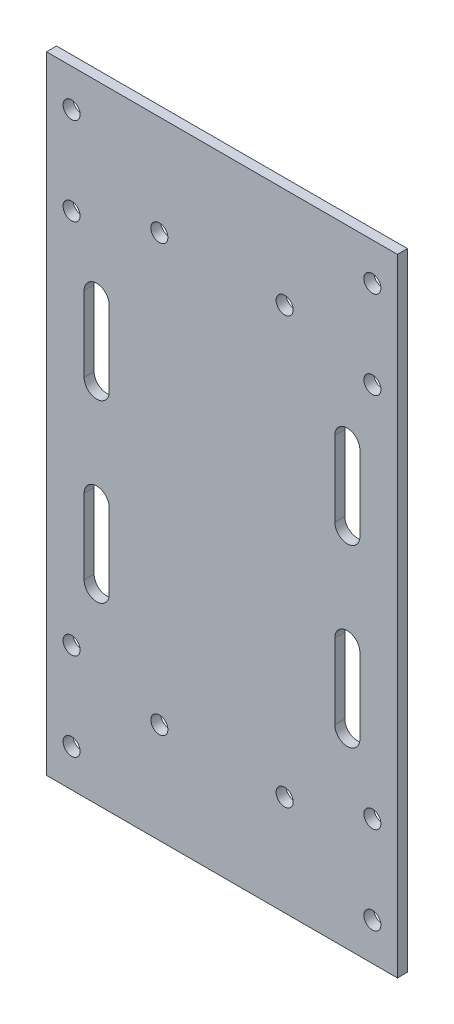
ISO-10303-21;
HEADER;
FILE_DESCRIPTION(('STEP AP214'),'2;1');
FILE_NAME('part.step','',(''),(''),'','','');
FILE_SCHEMA(('AUTOMOTIVE_DESIGN { 1 0 10303 214 1 1 1 1 }'));
ENDSEC;
DATA;
#1=APPLICATION_CONTEXT('core data for automotive mechanical design processes');
#2=APPLICATION_PROTOCOL_DEFINITION('international standard','automotive_design',2000,#1);
#3=PRODUCT_CONTEXT('',#1,'mechanical');
#4=PRODUCT('Part','Part','',(#3));
#5=PRODUCT_RELATED_PRODUCT_CATEGORY('part','',(#4));
#6=PRODUCT_DEFINITION_FORMATION('','',#4);
#7=PRODUCT_DEFINITION_CONTEXT('part definition',#1,'design');
#8=PRODUCT_DEFINITION('design','',#6,#7);
#9=PRODUCT_DEFINITION_SHAPE('','',#8);
#10=(LENGTH_UNIT() NAMED_UNIT(*) SI_UNIT(.MILLI.,.METRE.));
#11=(NAMED_UNIT(*) PLANE_ANGLE_UNIT() SI_UNIT($,.RADIAN.));
#12=(NAMED_UNIT(*) SI_UNIT($,.STERADIAN.) SOLID_ANGLE_UNIT());
#13=UNCERTAINTY_MEASURE_WITH_UNIT(LENGTH_MEASURE(1.E-05),#10,'distance_accuracy_value','');
#14=(GEOMETRIC_REPRESENTATION_CONTEXT(3) GLOBAL_UNCERTAINTY_ASSIGNED_CONTEXT((#13)) GLOBAL_UNIT_ASSIGNED_CONTEXT((#10,
#11,#12)) REPRESENTATION_CONTEXT('',''));
#15=CARTESIAN_POINT('',(0.,0.,0.));
#16=DIRECTION('',(0.,0.,1.));
#17=DIRECTION('',(1.,0.,0.));
#18=AXIS2_PLACEMENT_3D('',#15,#16,#17);
#19=CARTESIAN_POINT('',(0.,0.,0.));
#20=DIRECTION('',(0.,0.,-1.));
#21=DIRECTION('',(-1.,0.,0.));
#22=AXIS2_PLACEMENT_3D('',#19,#20,#21);
#23=PLANE('',#22);
#24=CARTESIAN_POINT('',(25.,-25.,0.));
#25=DIRECTION('',(0.,0.,-1.));
#26=DIRECTION('',(-1.,0.,0.));
#27=AXIS2_PLACEMENT_3D('',#24,#25,#26);
#28=CIRCLE('',#27,2.5);
#29=CARTESIAN_POINT('',(22.5,-25.,0.));
#30=VERTEX_POINT('',#29);
#31=CARTESIAN_POINT('',(27.5,-25.,0.));
#32=VERTEX_POINT('',#31);
#33=EDGE_CURVE('E556',#30,#32,#28,.F.);
#34=ORIENTED_EDGE('',*,*,#33,.F.);
#35=DIRECTION('',(0.,-1.,0.));
#36=VECTOR('',#35,1.);
#37=CARTESIAN_POINT('',(22.5,0.,0.));
#38=LINE('',#37,#36);
#39=CARTESIAN_POINT('',(22.5,-10.,0.));
#40=VERTEX_POINT('',#39);
#41=EDGE_CURVE('E261',#40,#30,#38,.T.);
#42=ORIENTED_EDGE('',*,*,#41,.F.);
#43=CARTESIAN_POINT('',(25.,-10.,0.));
#44=DIRECTION('',(0.,0.,-1.));
#45=DIRECTION('',(-1.,0.,0.));
#46=AXIS2_PLACEMENT_3D('',#43,#44,#45);
#47=CIRCLE('',#46,2.5);
#48=CARTESIAN_POINT('',(27.5,-10.,0.));
#49=VERTEX_POINT('',#48);
#50=EDGE_CURVE('E565',#49,#40,#47,.F.);
#51=ORIENTED_EDGE('',*,*,#50,.F.);
#52=DIRECTION('',(0.,1.,0.));
#53=VECTOR('',#52,1.);
#54=CARTESIAN_POINT('',(27.5,0.,0.));
#55=LINE('',#54,#53);
#56=EDGE_CURVE('E262',#32,#49,#55,.T.);
#57=ORIENTED_EDGE('',*,*,#56,.F.);
#58=EDGE_LOOP('',(#34,#42,#51,#57));
#59=FACE_BOUND('',#58,.T.);
#60=CARTESIAN_POINT('',(-25.,25.,0.));
#61=DIRECTION('',(0.,0.,-1.));
#62=DIRECTION('',(-1.,0.,0.));
#63=AXIS2_PLACEMENT_3D('',#60,#61,#62);
#64=CIRCLE('',#63,2.5);
#65=CARTESIAN_POINT('',(-22.5,25.,0.));
#66=VERTEX_POINT('',#65);
#67=CARTESIAN_POINT('',(-27.5,25.,0.));
#68=VERTEX_POINT('',#67);
#69=EDGE_CURVE('E567',#66,#68,#64,.F.);
#70=ORIENTED_EDGE('',*,*,#69,.F.);
#71=DIRECTION('',(0.,1.,0.));
#72=VECTOR('',#71,1.);
#73=CARTESIAN_POINT('',(-22.5,0.,0.));
#74=LINE('',#73,#72);
#75=CARTESIAN_POINT('',(-22.5,10.,0.));
#76=VERTEX_POINT('',#75);
#77=EDGE_CURVE('E269',#76,#66,#74,.T.);
#78=ORIENTED_EDGE('',*,*,#77,.F.);
#79=CARTESIAN_POINT('',(-25.,10.,0.));
#80=DIRECTION('',(0.,0.,-1.));
#81=DIRECTION('',(-1.,0.,0.));
#82=AXIS2_PLACEMENT_3D('',#79,#80,#81);
#83=CIRCLE('',#82,2.5);
#84=CARTESIAN_POINT('',(-27.5,10.,0.));
#85=VERTEX_POINT('',#84);
#86=EDGE_CURVE('E192',#85,#76,#83,.F.);
#87=ORIENTED_EDGE('',*,*,#86,.F.);
#88=DIRECTION('',(0.,-1.,0.));
#89=VECTOR('',#88,1.);
#90=CARTESIAN_POINT('',(-27.5,0.,0.));
#91=LINE('',#90,#89);
#92=EDGE_CURVE('E270',#68,#85,#91,.T.);
#93=ORIENTED_EDGE('',*,*,#92,.F.);
#94=EDGE_LOOP('',(#70,#78,#87,#93));
#95=FACE_BOUND('',#94,.T.);
#96=CARTESIAN_POINT('',(-25.,-10.,0.));
#97=DIRECTION('',(0.,0.,-1.));
#98=DIRECTION('',(-1.,0.,0.));
#99=AXIS2_PLACEMENT_3D('',#96,#97,#98);
#100=CIRCLE('',#99,2.5);
#101=CARTESIAN_POINT('',(-22.5,-10.,0.));
#102=VERTEX_POINT('',#101);
#103=CARTESIAN_POINT('',(-27.5,-10.,0.));
#104=VERTEX_POINT('',#103);
#105=EDGE_CURVE('E579',#102,#104,#100,.F.);
#106=ORIENTED_EDGE('',*,*,#105,.F.);
#107=DIRECTION('',(0.,1.,0.));
#108=VECTOR('',#107,1.);
#109=CARTESIAN_POINT('',(-22.5,0.,0.));
#110=LINE('',#109,#108);
#111=CARTESIAN_POINT('',(-22.5,-25.,0.));
#112=VERTEX_POINT('',#111);
#113=EDGE_CURVE('E252',#112,#102,#110,.T.);
#114=ORIENTED_EDGE('',*,*,#113,.F.);
#115=CARTESIAN_POINT('',(-25.,-25.,0.));
#116=DIRECTION('',(0.,0.,-1.));
#117=DIRECTION('',(-1.,0.,0.));
#118=AXIS2_PLACEMENT_3D('',#115,#116,#117);
#119=CIRCLE('',#118,2.5);
#120=CARTESIAN_POINT('',(-27.5,-25.,0.));
#121=VERTEX_POINT('',#120);
#122=EDGE_CURVE('E576',#121,#112,#119,.F.);
#123=ORIENTED_EDGE('',*,*,#122,.F.);
#124=DIRECTION('',(0.,-1.,0.));
#125=VECTOR('',#124,1.);
#126=CARTESIAN_POINT('',(-27.5,0.,0.));
#127=LINE('',#126,#125);
#128=EDGE_CURVE('E248',#104,#121,#127,.T.);
#129=ORIENTED_EDGE('',*,*,#128,.F.);
#130=EDGE_LOOP('',(#106,#114,#123,#129));
#131=FACE_BOUND('',#130,.T.);
#132=CARTESIAN_POINT('',(25.,10.,0.));
#133=DIRECTION('',(0.,0.,-1.));
#134=DIRECTION('',(-1.,0.,0.));
#135=AXIS2_PLACEMENT_3D('',#132,#133,#134);
#136=CIRCLE('',#135,2.5);
#137=CARTESIAN_POINT('',(22.5,10.,0.));
#138=VERTEX_POINT('',#137);
#139=CARTESIAN_POINT('',(27.5,10.,0.));
#140=VERTEX_POINT('',#139);
#141=EDGE_CURVE('E566',#138,#140,#136,.F.);
#142=ORIENTED_EDGE('',*,*,#141,.F.);
#143=DIRECTION('',(0.,-1.,0.));
#144=VECTOR('',#143,1.);
#145=CARTESIAN_POINT('',(22.5,0.,0.));
#146=LINE('',#145,#144);
#147=CARTESIAN_POINT('',(22.5,25.,0.));
#148=VERTEX_POINT('',#147);
#149=EDGE_CURVE('E254',#148,#138,#146,.T.);
#150=ORIENTED_EDGE('',*,*,#149,.F.);
#151=CARTESIAN_POINT('',(25.,25.,0.));
#152=DIRECTION('',(0.,0.,-1.));
#153=DIRECTION('',(-1.,0.,0.));
#154=AXIS2_PLACEMENT_3D('',#151,#152,#153);
#155=CIRCLE('',#154,2.5);
#156=CARTESIAN_POINT('',(27.5,25.,0.));
#157=VERTEX_POINT('',#156);
#158=EDGE_CURVE('E575',#157,#148,#155,.F.);
#159=ORIENTED_EDGE('',*,*,#158,.F.);
#160=DIRECTION('',(0.,1.,0.));
#161=VECTOR('',#160,1.);
#162=CARTESIAN_POINT('',(27.5,0.,0.));
#163=LINE('',#162,#161);
#164=EDGE_CURVE('E256',#140,#157,#163,.T.);
#165=ORIENTED_EDGE('',*,*,#164,.F.);
#166=EDGE_LOOP('',(#142,#150,#159,#165));
#167=FACE_BOUND('',#166,.T.);
#168=DIRECTION('',(0.,1.,0.));
#169=VECTOR('',#168,1.);
#170=CARTESIAN_POINT('',(35.,-62.5,0.));
#171=LINE('',#170,#169);
#172=CARTESIAN_POINT('',(35.,-62.5,0.));
#173=VERTEX_POINT('',#172);
#174=CARTESIAN_POINT('',(35.,62.5,0.));
#175=VERTEX_POINT('',#174);
#176=EDGE_CURVE('E964',#173,#175,#171,.T.);
#177=ORIENTED_EDGE('',*,*,#176,.T.);
#178=DIRECTION('',(-1.,0.,0.));
#179=VECTOR('',#178,1.);
#180=CARTESIAN_POINT('',(-35.,62.5,0.));
#181=LINE('',#180,#179);
#182=CARTESIAN_POINT('',(-35.,62.5,0.));
#183=VERTEX_POINT('',#182);
#184=EDGE_CURVE('E968',#175,#183,#181,.T.);
#185=ORIENTED_EDGE('',*,*,#184,.T.);
#186=DIRECTION('',(0.,-1.,0.));
#187=VECTOR('',#186,1.);
#188=CARTESIAN_POINT('',(-35.,-62.5,0.));
#189=LINE('',#188,#187);
#190=CARTESIAN_POINT('',(-35.,-62.5,0.));
#191=VERTEX_POINT('',#190);
#192=EDGE_CURVE('E969',#183,#191,#189,.T.);
#193=ORIENTED_EDGE('',*,*,#192,.T.);
#194=DIRECTION('',(1.,0.,0.));
#195=VECTOR('',#194,1.);
#196=CARTESIAN_POINT('',(-35.,-62.5,0.));
#197=LINE('',#196,#195);
#198=EDGE_CURVE('E966',#191,#173,#197,.T.);
#199=ORIENTED_EDGE('',*,*,#198,.T.);
#200=EDGE_LOOP('',(#177,#185,#193,#199));
#201=FACE_BOUND('',#200,.T.);
#202=CARTESIAN_POINT('',(-30.,-55.,1.2E-05));
#203=DIRECTION('',(0.,0.,1.));
#204=DIRECTION('',(1.,0.,0.));
#205=AXIS2_PLACEMENT_3D('',#202,#203,#204);
#206=CIRCLE('',#205,1.7);
#207=CARTESIAN_POINT('',(-28.3,-55.,1.2E-05));
#208=VERTEX_POINT('',#207);
#209=EDGE_CURVE('E317',#208,#208,#206,.T.);
#210=ORIENTED_EDGE('',*,*,#209,.F.);
#211=EDGE_LOOP('',(#210));
#212=FACE_BOUND('',#211,.T.);
#213=CARTESIAN_POINT('',(-12.5,42.5,1.2E-05));
#214=DIRECTION('',(0.,0.,1.));
#215=DIRECTION('',(1.,0.,0.));
#216=AXIS2_PLACEMENT_3D('',#213,#214,#215);
#217=CIRCLE('',#216,1.7);
#218=CARTESIAN_POINT('',(-10.8,42.5,1.2E-05));
#219=VERTEX_POINT('',#218);
#220=EDGE_CURVE('E283',#219,#219,#217,.T.);
#221=ORIENTED_EDGE('',*,*,#220,.F.);
#222=EDGE_LOOP('',(#221));
#223=FACE_BOUND('',#222,.T.);
#224=CARTESIAN_POINT('',(12.5,-42.5,1.2E-05));
#225=DIRECTION('',(0.,0.,1.));
#226=DIRECTION('',(1.,0.,0.));
#227=AXIS2_PLACEMENT_3D('',#224,#225,#226);
#228=CIRCLE('',#227,1.7);
#229=CARTESIAN_POINT('',(14.2,-42.5,1.2E-05));
#230=VERTEX_POINT('',#229);
#231=EDGE_CURVE('E277',#230,#230,#228,.T.);
#232=ORIENTED_EDGE('',*,*,#231,.F.);
#233=EDGE_LOOP('',(#232));
#234=FACE_BOUND('',#233,.T.);
#235=CARTESIAN_POINT('',(12.5,42.5,1.2E-05));
#236=DIRECTION('',(0.,0.,1.));
#237=DIRECTION('',(1.,0.,0.));
#238=AXIS2_PLACEMENT_3D('',#235,#236,#237);
#239=CIRCLE('',#238,1.7);
#240=CARTESIAN_POINT('',(14.2,42.5,1.2E-05));
#241=VERTEX_POINT('',#240);
#242=EDGE_CURVE('E275',#241,#241,#239,.T.);
#243=ORIENTED_EDGE('',*,*,#242,.F.);
#244=EDGE_LOOP('',(#243));
#245=FACE_BOUND('',#244,.T.);
#246=CARTESIAN_POINT('',(30.,-55.,1.2E-05));
#247=DIRECTION('',(0.,0.,1.));
#248=DIRECTION('',(1.,0.,0.));
#249=AXIS2_PLACEMENT_3D('',#246,#247,#248);
#250=CIRCLE('',#249,1.7);
#251=CARTESIAN_POINT('',(31.7,-55.,1.2E-05));
#252=VERTEX_POINT('',#251);
#253=EDGE_CURVE('E298',#252,#252,#250,.T.);
#254=ORIENTED_EDGE('',*,*,#253,.F.);
#255=EDGE_LOOP('',(#254));
#256=FACE_BOUND('',#255,.T.);
#257=CARTESIAN_POINT('',(-30.,55.,1.2E-05));
#258=DIRECTION('',(0.,0.,1.));
#259=DIRECTION('',(1.,0.,0.));
#260=AXIS2_PLACEMENT_3D('',#257,#258,#259);
#261=CIRCLE('',#260,1.7);
#262=CARTESIAN_POINT('',(-28.3,55.,1.2E-05));
#263=VERTEX_POINT('',#262);
#264=EDGE_CURVE('E305',#263,#263,#261,.T.);
#265=ORIENTED_EDGE('',*,*,#264,.F.);
#266=EDGE_LOOP('',(#265));
#267=FACE_BOUND('',#266,.T.);
#268=CARTESIAN_POINT('',(-30.,37.5,1.2E-05));
#269=DIRECTION('',(0.,0.,1.));
#270=DIRECTION('',(1.,0.,0.));
#271=AXIS2_PLACEMENT_3D('',#268,#269,#270);
#272=CIRCLE('',#271,1.7);
#273=CARTESIAN_POINT('',(-28.3,37.5,1.2E-05));
#274=VERTEX_POINT('',#273);
#275=EDGE_CURVE('E303',#274,#274,#272,.T.);
#276=ORIENTED_EDGE('',*,*,#275,.F.);
#277=EDGE_LOOP('',(#276));
#278=FACE_BOUND('',#277,.T.);
#279=CARTESIAN_POINT('',(-30.,-37.5,1.2E-05));
#280=DIRECTION('',(0.,0.,1.));
#281=DIRECTION('',(1.,0.,0.));
#282=AXIS2_PLACEMENT_3D('',#279,#280,#281);
#283=CIRCLE('',#282,1.7);
#284=CARTESIAN_POINT('',(-28.3,-37.5,1.2E-05));
#285=VERTEX_POINT('',#284);
#286=EDGE_CURVE('E311',#285,#285,#283,.T.);
#287=ORIENTED_EDGE('',*,*,#286,.F.);
#288=EDGE_LOOP('',(#287));
#289=FACE_BOUND('',#288,.T.);
#290=CARTESIAN_POINT('',(-12.5,-42.5,1.2E-05));
#291=DIRECTION('',(0.,0.,1.));
#292=DIRECTION('',(1.,0.,0.));
#293=AXIS2_PLACEMENT_3D('',#290,#291,#292);
#294=CIRCLE('',#293,1.7);
#295=CARTESIAN_POINT('',(-10.8,-42.5,1.2E-05));
#296=VERTEX_POINT('',#295);
#297=EDGE_CURVE('E278',#296,#296,#294,.T.);
#298=ORIENTED_EDGE('',*,*,#297,.F.);
#299=EDGE_LOOP('',(#298));
#300=FACE_BOUND('',#299,.T.);
#301=CARTESIAN_POINT('',(30.,55.,1.2E-05));
#302=DIRECTION('',(0.,0.,1.));
#303=DIRECTION('',(1.,0.,0.));
#304=AXIS2_PLACEMENT_3D('',#301,#302,#303);
#305=CIRCLE('',#304,1.7);
#306=CARTESIAN_POINT('',(31.7,55.,1.2E-05));
#307=VERTEX_POINT('',#306);
#308=EDGE_CURVE('E288',#307,#307,#305,.T.);
#309=ORIENTED_EDGE('',*,*,#308,.F.);
#310=EDGE_LOOP('',(#309));
#311=FACE_BOUND('',#310,.T.);
#312=CARTESIAN_POINT('',(30.,37.5,1.2E-05));
#313=DIRECTION('',(0.,0.,1.));
#314=DIRECTION('',(1.,0.,0.));
#315=AXIS2_PLACEMENT_3D('',#312,#313,#314);
#316=CIRCLE('',#315,1.7);
#317=CARTESIAN_POINT('',(31.7,37.5,1.2E-05));
#318=VERTEX_POINT('',#317);
#319=EDGE_CURVE('E289',#318,#318,#316,.T.);
#320=ORIENTED_EDGE('',*,*,#319,.F.);
#321=EDGE_LOOP('',(#320));
#322=FACE_BOUND('',#321,.T.);
#323=CARTESIAN_POINT('',(30.,-37.5,1.2E-05));
#324=DIRECTION('',(0.,0.,1.));
#325=DIRECTION('',(1.,0.,0.));
#326=AXIS2_PLACEMENT_3D('',#323,#324,#325);
#327=CIRCLE('',#326,1.7);
#328=CARTESIAN_POINT('',(31.7,-37.5,1.2E-05));
#329=VERTEX_POINT('',#328);
#330=EDGE_CURVE('E299',#329,#329,#327,.T.);
#331=ORIENTED_EDGE('',*,*,#330,.F.);
#332=EDGE_LOOP('',(#331));
#333=FACE_BOUND('',#332,.T.);
#334=ADVANCED_FACE('F39',(#59,#95,#131,#167,#201,#212,#223,#234,#245,#256,#267,#278,#289,#300,
#311,#322,#333),#23,.F.);
#335=CARTESIAN_POINT('',(0.,0.,-2.));
#336=DIRECTION('',(0.,0.,-1.));
#337=DIRECTION('',(-1.,0.,0.));
#338=AXIS2_PLACEMENT_3D('',#335,#336,#337);
#339=PLANE('',#338);
#340=CARTESIAN_POINT('',(30.,-37.5,-2.));
#341=DIRECTION('',(0.,0.,1.));
#342=DIRECTION('',(1.,0.,0.));
#343=AXIS2_PLACEMENT_3D('',#340,#341,#342);
#344=CIRCLE('',#343,1.7);
#345=CARTESIAN_POINT('',(31.7,-37.5,-2.));
#346=VERTEX_POINT('',#345);
#347=EDGE_CURVE('E291',#346,#346,#344,.T.);
#348=ORIENTED_EDGE('',*,*,#347,.T.);
#349=EDGE_LOOP('',(#348));
#350=FACE_BOUND('',#349,.T.);
#351=CARTESIAN_POINT('',(30.,37.5,-2.));
#352=DIRECTION('',(0.,0.,1.));
#353=DIRECTION('',(1.,0.,0.));
#354=AXIS2_PLACEMENT_3D('',#351,#352,#353);
#355=CIRCLE('',#354,1.7);
#356=CARTESIAN_POINT('',(31.7,37.5,-2.));
#357=VERTEX_POINT('',#356);
#358=EDGE_CURVE('E297',#357,#357,#355,.T.);
#359=ORIENTED_EDGE('',*,*,#358,.T.);
#360=EDGE_LOOP('',(#359));
#361=FACE_BOUND('',#360,.T.);
#362=CARTESIAN_POINT('',(30.,55.,-2.));
#363=DIRECTION('',(0.,0.,1.));
#364=DIRECTION('',(1.,0.,0.));
#365=AXIS2_PLACEMENT_3D('',#362,#363,#364);
#366=CIRCLE('',#365,1.7);
#367=CARTESIAN_POINT('',(31.7,55.,-2.));
#368=VERTEX_POINT('',#367);
#369=EDGE_CURVE('E281',#368,#368,#366,.T.);
#370=ORIENTED_EDGE('',*,*,#369,.T.);
#371=EDGE_LOOP('',(#370));
#372=FACE_BOUND('',#371,.T.);
#373=CARTESIAN_POINT('',(-12.5,-42.5,-2.));
#374=DIRECTION('',(0.,0.,1.));
#375=DIRECTION('',(1.,0.,0.));
#376=AXIS2_PLACEMENT_3D('',#373,#374,#375);
#377=CIRCLE('',#376,1.7);
#378=CARTESIAN_POINT('',(-10.8,-42.5,-2.));
#379=VERTEX_POINT('',#378);
#380=EDGE_CURVE('E290',#379,#379,#377,.T.);
#381=ORIENTED_EDGE('',*,*,#380,.T.);
#382=EDGE_LOOP('',(#381));
#383=FACE_BOUND('',#382,.T.);
#384=CARTESIAN_POINT('',(-30.,-37.5,-2.));
#385=DIRECTION('',(0.,0.,1.));
#386=DIRECTION('',(1.,0.,0.));
#387=AXIS2_PLACEMENT_3D('',#384,#385,#386);
#388=CIRCLE('',#387,1.7);
#389=CARTESIAN_POINT('',(-28.3,-37.5,-2.));
#390=VERTEX_POINT('',#389);
#391=EDGE_CURVE('E310',#390,#390,#388,.T.);
#392=ORIENTED_EDGE('',*,*,#391,.T.);
#393=EDGE_LOOP('',(#392));
#394=FACE_BOUND('',#393,.T.);
#395=CARTESIAN_POINT('',(-30.,37.5,-2.));
#396=DIRECTION('',(0.,0.,1.));
#397=DIRECTION('',(1.,0.,0.));
#398=AXIS2_PLACEMENT_3D('',#395,#396,#397);
#399=CIRCLE('',#398,1.7);
#400=CARTESIAN_POINT('',(-28.3,37.5,-2.));
#401=VERTEX_POINT('',#400);
#402=EDGE_CURVE('E314',#401,#401,#399,.T.);
#403=ORIENTED_EDGE('',*,*,#402,.T.);
#404=EDGE_LOOP('',(#403));
#405=FACE_BOUND('',#404,.T.);
#406=CARTESIAN_POINT('',(-30.,55.,-2.));
#407=DIRECTION('',(0.,0.,1.));
#408=DIRECTION('',(1.,0.,0.));
#409=AXIS2_PLACEMENT_3D('',#406,#407,#408);
#410=CIRCLE('',#409,1.7);
#411=CARTESIAN_POINT('',(-28.3,55.,-2.));
#412=VERTEX_POINT('',#411);
#413=EDGE_CURVE('E301',#412,#412,#410,.T.);
#414=ORIENTED_EDGE('',*,*,#413,.T.);
#415=EDGE_LOOP('',(#414));
#416=FACE_BOUND('',#415,.T.);
#417=CARTESIAN_POINT('',(30.,-55.,-2.));
#418=DIRECTION('',(0.,0.,1.));
#419=DIRECTION('',(1.,0.,0.));
#420=AXIS2_PLACEMENT_3D('',#417,#418,#419);
#421=CIRCLE('',#420,1.7);
#422=CARTESIAN_POINT('',(31.7,-55.,-2.));
#423=VERTEX_POINT('',#422);
#424=EDGE_CURVE('E308',#423,#423,#421,.T.);
#425=ORIENTED_EDGE('',*,*,#424,.T.);
#426=EDGE_LOOP('',(#425));
#427=FACE_BOUND('',#426,.T.);
#428=CARTESIAN_POINT('',(12.5,42.5,-2.));
#429=DIRECTION('',(0.,0.,1.));
#430=DIRECTION('',(1.,0.,0.));
#431=AXIS2_PLACEMENT_3D('',#428,#429,#430);
#432=CIRCLE('',#431,1.7);
#433=CARTESIAN_POINT('',(14.2,42.5,-2.));
#434=VERTEX_POINT('',#433);
#435=EDGE_CURVE('E272',#434,#434,#432,.T.);
#436=ORIENTED_EDGE('',*,*,#435,.T.);
#437=EDGE_LOOP('',(#436));
#438=FACE_BOUND('',#437,.T.);
#439=CARTESIAN_POINT('',(12.5,-42.5,-2.));
#440=DIRECTION('',(0.,0.,1.));
#441=DIRECTION('',(1.,0.,0.));
#442=AXIS2_PLACEMENT_3D('',#439,#440,#441);
#443=CIRCLE('',#442,1.7);
#444=CARTESIAN_POINT('',(14.2,-42.5,-2.));
#445=VERTEX_POINT('',#444);
#446=EDGE_CURVE('E284',#445,#445,#443,.T.);
#447=ORIENTED_EDGE('',*,*,#446,.T.);
#448=EDGE_LOOP('',(#447));
#449=FACE_BOUND('',#448,.T.);
#450=CARTESIAN_POINT('',(-12.5,42.5,-2.));
#451=DIRECTION('',(0.,0.,1.));
#452=DIRECTION('',(1.,0.,0.));
#453=AXIS2_PLACEMENT_3D('',#450,#451,#452);
#454=CIRCLE('',#453,1.7);
#455=CARTESIAN_POINT('',(-10.8,42.5,-2.));
#456=VERTEX_POINT('',#455);
#457=EDGE_CURVE('E280',#456,#456,#454,.T.);
#458=ORIENTED_EDGE('',*,*,#457,.T.);
#459=EDGE_LOOP('',(#458));
#460=FACE_BOUND('',#459,.T.);
#461=CARTESIAN_POINT('',(-30.,-55.,-2.));
#462=DIRECTION('',(0.,0.,1.));
#463=DIRECTION('',(1.,0.,0.));
#464=AXIS2_PLACEMENT_3D('',#461,#462,#463);
#465=CIRCLE('',#464,1.7);
#466=CARTESIAN_POINT('',(-28.3,-55.,-2.));
#467=VERTEX_POINT('',#466);
#468=EDGE_CURVE('E315',#467,#467,#465,.T.);
#469=ORIENTED_EDGE('',*,*,#468,.T.);
#470=EDGE_LOOP('',(#469));
#471=FACE_BOUND('',#470,.T.);
#472=DIRECTION('',(0.,1.,0.));
#473=VECTOR('',#472,1.);
#474=CARTESIAN_POINT('',(35.,-62.5,-2.));
#475=LINE('',#474,#473);
#476=CARTESIAN_POINT('',(35.,-62.5,-2.));
#477=VERTEX_POINT('',#476);
#478=CARTESIAN_POINT('',(35.,62.5,-2.));
#479=VERTEX_POINT('',#478);
#480=EDGE_CURVE('E420',#477,#479,#475,.T.);
#481=ORIENTED_EDGE('',*,*,#480,.F.);
#482=DIRECTION('',(1.,0.,0.));
#483=VECTOR('',#482,1.);
#484=CARTESIAN_POINT('',(-35.,-62.5,-2.));
#485=LINE('',#484,#483);
#486=CARTESIAN_POINT('',(-35.,-62.5,-2.));
#487=VERTEX_POINT('',#486);
#488=EDGE_CURVE('E977',#487,#477,#485,.T.);
#489=ORIENTED_EDGE('',*,*,#488,.F.);
#490=DIRECTION('',(0.,-1.,0.));
#491=VECTOR('',#490,1.);
#492=CARTESIAN_POINT('',(-35.,-62.5,-2.));
#493=LINE('',#492,#491);
#494=CARTESIAN_POINT('',(-35.,62.5,-2.));
#495=VERTEX_POINT('',#494);
#496=EDGE_CURVE('E987',#495,#487,#493,.T.);
#497=ORIENTED_EDGE('',*,*,#496,.F.);
#498=DIRECTION('',(-1.,0.,0.));
#499=VECTOR('',#498,1.);
#500=CARTESIAN_POINT('',(-35.,62.5,-2.));
#501=LINE('',#500,#499);
#502=EDGE_CURVE('E975',#479,#495,#501,.T.);
#503=ORIENTED_EDGE('',*,*,#502,.F.);
#504=EDGE_LOOP('',(#481,#489,#497,#503));
#505=FACE_BOUND('',#504,.T.);
#506=DIRECTION('',(0.,1.,0.));
#507=VECTOR('',#506,1.);
#508=CARTESIAN_POINT('',(-22.5,-25.,-2.));
#509=LINE('',#508,#507);
#510=CARTESIAN_POINT('',(-22.5,-25.,-2.));
#511=VERTEX_POINT('',#510);
#512=CARTESIAN_POINT('',(-22.5,-10.,-2.));
#513=VERTEX_POINT('',#512);
#514=EDGE_CURVE('E213',#511,#513,#509,.T.);
#515=ORIENTED_EDGE('',*,*,#514,.T.);
#516=CARTESIAN_POINT('',(-25.,-10.,-2.));
#517=DIRECTION('',(0.,0.,1.));
#518=DIRECTION('',(1.,0.,0.));
#519=AXIS2_PLACEMENT_3D('',#516,#517,#518);
#520=CIRCLE('',#519,2.5);
#521=CARTESIAN_POINT('',(-27.5,-10.,-2.));
#522=VERTEX_POINT('',#521);
#523=EDGE_CURVE('E210',#513,#522,#520,.T.);
#524=ORIENTED_EDGE('',*,*,#523,.T.);
#525=DIRECTION('',(0.,-1.,0.));
#526=VECTOR('',#525,1.);
#527=CARTESIAN_POINT('',(-27.5,-25.,-2.));
#528=LINE('',#527,#526);
#529=CARTESIAN_POINT('',(-27.5,-25.,-2.));
#530=VERTEX_POINT('',#529);
#531=EDGE_CURVE('E216',#522,#530,#528,.T.);
#532=ORIENTED_EDGE('',*,*,#531,.T.);
#533=CARTESIAN_POINT('',(-25.,-25.,-2.));
#534=DIRECTION('',(0.,0.,1.));
#535=DIRECTION('',(1.,0.,0.));
#536=AXIS2_PLACEMENT_3D('',#533,#534,#535);
#537=CIRCLE('',#536,2.5);
#538=EDGE_CURVE('E605',#530,#511,#537,.T.);
#539=ORIENTED_EDGE('',*,*,#538,.T.);
#540=EDGE_LOOP('',(#515,#524,#532,#539));
#541=FACE_BOUND('',#540,.T.);
#542=DIRECTION('',(0.,-1.,0.));
#543=VECTOR('',#542,1.);
#544=CARTESIAN_POINT('',(22.5,10.,-2.));
#545=LINE('',#544,#543);
#546=CARTESIAN_POINT('',(22.5,25.,-2.));
#547=VERTEX_POINT('',#546);
#548=CARTESIAN_POINT('',(22.5,10.,-2.));
#549=VERTEX_POINT('',#548);
#550=EDGE_CURVE('E546',#547,#549,#545,.T.);
#551=ORIENTED_EDGE('',*,*,#550,.T.);
#552=CARTESIAN_POINT('',(25.,10.,-2.));
#553=DIRECTION('',(0.,0.,1.));
#554=DIRECTION('',(1.,0.,0.));
#555=AXIS2_PLACEMENT_3D('',#552,#553,#554);
#556=CIRCLE('',#555,2.5);
#557=CARTESIAN_POINT('',(27.5,10.,-2.));
#558=VERTEX_POINT('',#557);
#559=EDGE_CURVE('E608',#549,#558,#556,.T.);
#560=ORIENTED_EDGE('',*,*,#559,.T.);
#561=DIRECTION('',(0.,1.,0.));
#562=VECTOR('',#561,1.);
#563=CARTESIAN_POINT('',(27.5,10.,-2.));
#564=LINE('',#563,#562);
#565=CARTESIAN_POINT('',(27.5,25.,-2.));
#566=VERTEX_POINT('',#565);
#567=EDGE_CURVE('E221',#558,#566,#564,.T.);
#568=ORIENTED_EDGE('',*,*,#567,.T.);
#569=CARTESIAN_POINT('',(25.,25.,-2.));
#570=DIRECTION('',(0.,0.,1.));
#571=DIRECTION('',(1.,0.,0.));
#572=AXIS2_PLACEMENT_3D('',#569,#570,#571);
#573=CIRCLE('',#572,2.5);
#574=EDGE_CURVE('E609',#566,#547,#573,.T.);
#575=ORIENTED_EDGE('',*,*,#574,.T.);
#576=EDGE_LOOP('',(#551,#560,#568,#575));
#577=FACE_BOUND('',#576,.T.);
#578=DIRECTION('',(0.,-1.,0.));
#579=VECTOR('',#578,1.);
#580=CARTESIAN_POINT('',(22.5,-25.,-2.));
#581=LINE('',#580,#579);
#582=CARTESIAN_POINT('',(22.5,-10.,-2.));
#583=VERTEX_POINT('',#582);
#584=CARTESIAN_POINT('',(22.5,-25.,-2.));
#585=VERTEX_POINT('',#584);
#586=EDGE_CURVE('E231',#583,#585,#581,.T.);
#587=ORIENTED_EDGE('',*,*,#586,.T.);
#588=CARTESIAN_POINT('',(25.,-25.,-2.));
#589=DIRECTION('',(0.,0.,1.));
#590=DIRECTION('',(1.,0.,0.));
#591=AXIS2_PLACEMENT_3D('',#588,#589,#590);
#592=CIRCLE('',#591,2.5);
#593=CARTESIAN_POINT('',(27.5,-25.,-2.));
#594=VERTEX_POINT('',#593);
#595=EDGE_CURVE('E549',#585,#594,#592,.T.);
#596=ORIENTED_EDGE('',*,*,#595,.T.);
#597=DIRECTION('',(0.,1.,0.));
#598=VECTOR('',#597,1.);
#599=CARTESIAN_POINT('',(27.5,-25.,-2.));
#600=LINE('',#599,#598);
#601=CARTESIAN_POINT('',(27.5,-10.,-2.));
#602=VERTEX_POINT('',#601);
#603=EDGE_CURVE('E233',#594,#602,#600,.T.);
#604=ORIENTED_EDGE('',*,*,#603,.T.);
#605=CARTESIAN_POINT('',(25.,-10.,-2.));
#606=DIRECTION('',(0.,0.,1.));
#607=DIRECTION('',(1.,0.,0.));
#608=AXIS2_PLACEMENT_3D('',#605,#606,#607);
#609=CIRCLE('',#608,2.5);
#610=EDGE_CURVE('E555',#602,#583,#609,.T.);
#611=ORIENTED_EDGE('',*,*,#610,.T.);
#612=EDGE_LOOP('',(#587,#596,#604,#611));
#613=FACE_BOUND('',#612,.T.);
#614=DIRECTION('',(0.,1.,0.));
#615=VECTOR('',#614,1.);
#616=CARTESIAN_POINT('',(-22.5,10.,-2.));
#617=LINE('',#616,#615);
#618=CARTESIAN_POINT('',(-22.5,10.,-2.));
#619=VERTEX_POINT('',#618);
#620=CARTESIAN_POINT('',(-22.5,25.,-2.));
#621=VERTEX_POINT('',#620);
#622=EDGE_CURVE('E202',#619,#621,#617,.T.);
#623=ORIENTED_EDGE('',*,*,#622,.T.);
#624=CARTESIAN_POINT('',(-25.,25.,-2.));
#625=DIRECTION('',(0.,0.,1.));
#626=DIRECTION('',(1.,0.,0.));
#627=AXIS2_PLACEMENT_3D('',#624,#625,#626);
#628=CIRCLE('',#627,2.5);
#629=CARTESIAN_POINT('',(-27.5,25.,-2.));
#630=VERTEX_POINT('',#629);
#631=EDGE_CURVE('E208',#621,#630,#628,.T.);
#632=ORIENTED_EDGE('',*,*,#631,.T.);
#633=DIRECTION('',(0.,-1.,0.));
#634=VECTOR('',#633,1.);
#635=CARTESIAN_POINT('',(-27.5,10.,-2.));
#636=LINE('',#635,#634);
#637=CARTESIAN_POINT('',(-27.5,10.,-2.));
#638=VERTEX_POINT('',#637);
#639=EDGE_CURVE('E197',#630,#638,#636,.T.);
#640=ORIENTED_EDGE('',*,*,#639,.T.);
#641=CARTESIAN_POINT('',(-25.,10.,-2.));
#642=DIRECTION('',(0.,0.,1.));
#643=DIRECTION('',(1.,0.,0.));
#644=AXIS2_PLACEMENT_3D('',#641,#642,#643);
#645=CIRCLE('',#644,2.5);
#646=EDGE_CURVE('E190',#638,#619,#645,.T.);
#647=ORIENTED_EDGE('',*,*,#646,.T.);
#648=EDGE_LOOP('',(#623,#632,#640,#647));
#649=FACE_BOUND('',#648,.T.);
#650=ADVANCED_FACE('F201',(#350,#361,#372,#383,#394,#405,#416,#427,#438,#449,#460,#471,#505,
#541,#577,#613,#649),#339,.T.);
#651=CARTESIAN_POINT('',(35.,-62.5,-2.));
#652=DIRECTION('',(1.,0.,0.));
#653=DIRECTION('',(0.,0.,-1.));
#654=AXIS2_PLACEMENT_3D('',#651,#652,#653);
#655=PLANE('',#654);
#656=ORIENTED_EDGE('',*,*,#176,.F.);
#657=DIRECTION('',(0.,0.,1.));
#658=VECTOR('',#657,1.);
#659=CARTESIAN_POINT('',(35.,-62.5,-2.));
#660=LINE('',#659,#658);
#661=EDGE_CURVE('E11',#477,#173,#660,.T.);
#662=ORIENTED_EDGE('',*,*,#661,.F.);
#663=ORIENTED_EDGE('',*,*,#480,.T.);
#664=DIRECTION('',(0.,0.,1.));
#665=VECTOR('',#664,1.);
#666=CARTESIAN_POINT('',(35.,62.5,-2.));
#667=LINE('',#666,#665);
#668=EDGE_CURVE('E88',#479,#175,#667,.T.);
#669=ORIENTED_EDGE('',*,*,#668,.T.);
#670=EDGE_LOOP('',(#656,#662,#663,#669));
#671=FACE_BOUND('',#670,.T.);
#672=ADVANCED_FACE('F41',(#671),#655,.T.);
#673=CARTESIAN_POINT('',(-35.,-62.5,-2.));
#674=DIRECTION('',(0.,-1.,0.));
#675=DIRECTION('',(0.,0.,-1.));
#676=AXIS2_PLACEMENT_3D('',#673,#674,#675);
#677=PLANE('',#676);
#678=ORIENTED_EDGE('',*,*,#198,.F.);
#679=DIRECTION('',(0.,0.,1.));
#680=VECTOR('',#679,1.);
#681=CARTESIAN_POINT('',(-35.,-62.5,-2.));
#682=LINE('',#681,#680);
#683=EDGE_CURVE('E51',#487,#191,#682,.T.);
#684=ORIENTED_EDGE('',*,*,#683,.F.);
#685=ORIENTED_EDGE('',*,*,#488,.T.);
#686=ORIENTED_EDGE('',*,*,#661,.T.);
#687=EDGE_LOOP('',(#678,#684,#685,#686));
#688=FACE_BOUND('',#687,.T.);
#689=ADVANCED_FACE('F442',(#688),#677,.T.);
#690=CARTESIAN_POINT('',(-35.,-62.5,-2.));
#691=DIRECTION('',(-1.,0.,0.));
#692=DIRECTION('',(0.,0.,1.));
#693=AXIS2_PLACEMENT_3D('',#690,#691,#692);
#694=PLANE('',#693);
#695=ORIENTED_EDGE('',*,*,#192,.F.);
#696=DIRECTION('',(0.,0.,1.));
#697=VECTOR('',#696,1.);
#698=CARTESIAN_POINT('',(-35.,62.5,-2.));
#699=LINE('',#698,#697);
#700=EDGE_CURVE('E980',#495,#183,#699,.T.);
#701=ORIENTED_EDGE('',*,*,#700,.F.);
#702=ORIENTED_EDGE('',*,*,#496,.T.);
#703=ORIENTED_EDGE('',*,*,#683,.T.);
#704=EDGE_LOOP('',(#695,#701,#702,#703));
#705=FACE_BOUND('',#704,.T.);
#706=ADVANCED_FACE('F931',(#705),#694,.T.);
#707=CARTESIAN_POINT('',(-35.,62.5,-2.));
#708=DIRECTION('',(0.,1.,0.));
#709=DIRECTION('',(0.,0.,1.));
#710=AXIS2_PLACEMENT_3D('',#707,#708,#709);
#711=PLANE('',#710);
#712=ORIENTED_EDGE('',*,*,#184,.F.);
#713=ORIENTED_EDGE('',*,*,#668,.F.);
#714=ORIENTED_EDGE('',*,*,#502,.T.);
#715=ORIENTED_EDGE('',*,*,#700,.T.);
#716=EDGE_LOOP('',(#712,#713,#714,#715));
#717=FACE_BOUND('',#716,.T.);
#718=ADVANCED_FACE('F431',(#717),#711,.T.);
#719=CARTESIAN_POINT('',(-30.,-55.,1.2E-05));
#720=DIRECTION('',(0.,0.,-1.));
#721=DIRECTION('',(-1.,0.,0.));
#722=AXIS2_PLACEMENT_3D('',#719,#720,#721);
#723=CYLINDRICAL_SURFACE('',#722,1.7);
#724=ORIENTED_EDGE('',*,*,#209,.T.);
#725=EDGE_LOOP('',(#724));
#726=FACE_BOUND('',#725,.T.);
#727=ORIENTED_EDGE('',*,*,#468,.F.);
#728=EDGE_LOOP('',(#727));
#729=FACE_BOUND('',#728,.T.);
#730=ADVANCED_FACE('F423',(#726,#729),#723,.F.);
#731=CARTESIAN_POINT('',(-12.5,42.5,1.2E-05));
#732=DIRECTION('',(0.,0.,-1.));
#733=DIRECTION('',(-1.,0.,0.));
#734=AXIS2_PLACEMENT_3D('',#731,#732,#733);
#735=CYLINDRICAL_SURFACE('',#734,1.7);
#736=ORIENTED_EDGE('',*,*,#220,.T.);
#737=EDGE_LOOP('',(#736));
#738=FACE_BOUND('',#737,.T.);
#739=ORIENTED_EDGE('',*,*,#457,.F.);
#740=EDGE_LOOP('',(#739));
#741=FACE_BOUND('',#740,.T.);
#742=ADVANCED_FACE('F382',(#738,#741),#735,.F.);
#743=CARTESIAN_POINT('',(12.5,-42.5,1.2E-05));
#744=DIRECTION('',(0.,0.,-1.));
#745=DIRECTION('',(-1.,0.,0.));
#746=AXIS2_PLACEMENT_3D('',#743,#744,#745);
#747=CYLINDRICAL_SURFACE('',#746,1.7);
#748=ORIENTED_EDGE('',*,*,#231,.T.);
#749=EDGE_LOOP('',(#748));
#750=FACE_BOUND('',#749,.T.);
#751=ORIENTED_EDGE('',*,*,#446,.F.);
#752=EDGE_LOOP('',(#751));
#753=FACE_BOUND('',#752,.T.);
#754=ADVANCED_FACE('F378',(#750,#753),#747,.F.);
#755=CARTESIAN_POINT('',(12.5,42.5,1.2E-05));
#756=DIRECTION('',(0.,0.,-1.));
#757=DIRECTION('',(-1.,0.,0.));
#758=AXIS2_PLACEMENT_3D('',#755,#756,#757);
#759=CYLINDRICAL_SURFACE('',#758,1.7);
#760=ORIENTED_EDGE('',*,*,#242,.T.);
#761=EDGE_LOOP('',(#760));
#762=FACE_BOUND('',#761,.T.);
#763=ORIENTED_EDGE('',*,*,#435,.F.);
#764=EDGE_LOOP('',(#763));
#765=FACE_BOUND('',#764,.T.);
#766=ADVANCED_FACE('F385',(#762,#765),#759,.F.);
#767=CARTESIAN_POINT('',(30.,-55.,1.2E-05));
#768=DIRECTION('',(0.,0.,-1.));
#769=DIRECTION('',(-1.,0.,0.));
#770=AXIS2_PLACEMENT_3D('',#767,#768,#769);
#771=CYLINDRICAL_SURFACE('',#770,1.7);
#772=ORIENTED_EDGE('',*,*,#253,.T.);
#773=EDGE_LOOP('',(#772));
#774=FACE_BOUND('',#773,.T.);
#775=ORIENTED_EDGE('',*,*,#424,.F.);
#776=EDGE_LOOP('',(#775));
#777=FACE_BOUND('',#776,.T.);
#778=ADVANCED_FACE('F676',(#774,#777),#771,.F.);
#779=CARTESIAN_POINT('',(-30.,55.,1.2E-05));
#780=DIRECTION('',(0.,0.,-1.));
#781=DIRECTION('',(-1.,0.,0.));
#782=AXIS2_PLACEMENT_3D('',#779,#780,#781);
#783=CYLINDRICAL_SURFACE('',#782,1.7);
#784=ORIENTED_EDGE('',*,*,#264,.T.);
#785=EDGE_LOOP('',(#784));
#786=FACE_BOUND('',#785,.T.);
#787=ORIENTED_EDGE('',*,*,#413,.F.);
#788=EDGE_LOOP('',(#787));
#789=FACE_BOUND('',#788,.T.);
#790=ADVANCED_FACE('F348',(#786,#789),#783,.F.);
#791=CARTESIAN_POINT('',(-30.,37.5,1.2E-05));
#792=DIRECTION('',(0.,0.,-1.));
#793=DIRECTION('',(-1.,0.,0.));
#794=AXIS2_PLACEMENT_3D('',#791,#792,#793);
#795=CYLINDRICAL_SURFACE('',#794,1.7);
#796=ORIENTED_EDGE('',*,*,#275,.T.);
#797=EDGE_LOOP('',(#796));
#798=FACE_BOUND('',#797,.T.);
#799=ORIENTED_EDGE('',*,*,#402,.F.);
#800=EDGE_LOOP('',(#799));
#801=FACE_BOUND('',#800,.T.);
#802=ADVANCED_FACE('F435',(#798,#801),#795,.F.);
#803=CARTESIAN_POINT('',(-30.,-37.5,1.2E-05));
#804=DIRECTION('',(0.,0.,-1.));
#805=DIRECTION('',(-1.,0.,0.));
#806=AXIS2_PLACEMENT_3D('',#803,#804,#805);
#807=CYLINDRICAL_SURFACE('',#806,1.7);
#808=ORIENTED_EDGE('',*,*,#286,.T.);
#809=EDGE_LOOP('',(#808));
#810=FACE_BOUND('',#809,.T.);
#811=ORIENTED_EDGE('',*,*,#391,.F.);
#812=EDGE_LOOP('',(#811));
#813=FACE_BOUND('',#812,.T.);
#814=ADVANCED_FACE('F702',(#810,#813),#807,.F.);
#815=CARTESIAN_POINT('',(-12.5,-42.5,1.2E-05));
#816=DIRECTION('',(0.,0.,-1.));
#817=DIRECTION('',(-1.,0.,0.));
#818=AXIS2_PLACEMENT_3D('',#815,#816,#817);
#819=CYLINDRICAL_SURFACE('',#818,1.7);
#820=ORIENTED_EDGE('',*,*,#297,.T.);
#821=EDGE_LOOP('',(#820));
#822=FACE_BOUND('',#821,.T.);
#823=ORIENTED_EDGE('',*,*,#380,.F.);
#824=EDGE_LOOP('',(#823));
#825=FACE_BOUND('',#824,.T.);
#826=ADVANCED_FACE('F342',(#822,#825),#819,.F.);
#827=CARTESIAN_POINT('',(30.,55.,1.2E-05));
#828=DIRECTION('',(0.,0.,-1.));
#829=DIRECTION('',(-1.,0.,0.));
#830=AXIS2_PLACEMENT_3D('',#827,#828,#829);
#831=CYLINDRICAL_SURFACE('',#830,1.7);
#832=ORIENTED_EDGE('',*,*,#308,.T.);
#833=EDGE_LOOP('',(#832));
#834=FACE_BOUND('',#833,.T.);
#835=ORIENTED_EDGE('',*,*,#369,.F.);
#836=EDGE_LOOP('',(#835));
#837=FACE_BOUND('',#836,.T.);
#838=ADVANCED_FACE('F346',(#834,#837),#831,.F.);
#839=CARTESIAN_POINT('',(30.,37.5,1.2E-05));
#840=DIRECTION('',(0.,0.,-1.));
#841=DIRECTION('',(-1.,0.,0.));
#842=AXIS2_PLACEMENT_3D('',#839,#840,#841);
#843=CYLINDRICAL_SURFACE('',#842,1.7);
#844=ORIENTED_EDGE('',*,*,#319,.T.);
#845=EDGE_LOOP('',(#844));
#846=FACE_BOUND('',#845,.T.);
#847=ORIENTED_EDGE('',*,*,#358,.F.);
#848=EDGE_LOOP('',(#847));
#849=FACE_BOUND('',#848,.T.);
#850=ADVANCED_FACE('F341',(#846,#849),#843,.F.);
#851=CARTESIAN_POINT('',(30.,-37.5,1.2E-05));
#852=DIRECTION('',(0.,0.,-1.));
#853=DIRECTION('',(-1.,0.,0.));
#854=AXIS2_PLACEMENT_3D('',#851,#852,#853);
#855=CYLINDRICAL_SURFACE('',#854,1.7);
#856=ORIENTED_EDGE('',*,*,#330,.T.);
#857=EDGE_LOOP('',(#856));
#858=FACE_BOUND('',#857,.T.);
#859=ORIENTED_EDGE('',*,*,#347,.F.);
#860=EDGE_LOOP('',(#859));
#861=FACE_BOUND('',#860,.T.);
#862=ADVANCED_FACE('F329',(#858,#861),#855,.F.);
#863=CARTESIAN_POINT('',(-22.5,-25.,0.082677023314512));
#864=DIRECTION('',(-1.,0.,0.));
#865=DIRECTION('',(0.,0.,1.));
#866=AXIS2_PLACEMENT_3D('',#863,#864,#865);
#867=PLANE('',#866);
#868=ORIENTED_EDGE('',*,*,#113,.T.);
#869=DIRECTION('',(0.,0.,-1.));
#870=VECTOR('',#869,1.);
#871=CARTESIAN_POINT('',(-22.5,-10.,0.082677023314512));
#872=LINE('',#871,#870);
#873=EDGE_CURVE('E246',#102,#513,#872,.T.);
#874=ORIENTED_EDGE('',*,*,#873,.T.);
#875=ORIENTED_EDGE('',*,*,#514,.F.);
#876=DIRECTION('',(0.,0.,-1.));
#877=VECTOR('',#876,1.);
#878=CARTESIAN_POINT('',(-22.5,-25.,0.082677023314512));
#879=LINE('',#878,#877);
#880=EDGE_CURVE('E239',#112,#511,#879,.T.);
#881=ORIENTED_EDGE('',*,*,#880,.F.);
#882=EDGE_LOOP('',(#868,#874,#875,#881));
#883=FACE_BOUND('',#882,.T.);
#884=ADVANCED_FACE('F336',(#883),#867,.T.);
#885=CARTESIAN_POINT('',(-27.5,-25.,0.082677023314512));
#886=DIRECTION('',(1.,0.,0.));
#887=DIRECTION('',(0.,0.,-1.));
#888=AXIS2_PLACEMENT_3D('',#885,#886,#887);
#889=PLANE('',#888);
#890=ORIENTED_EDGE('',*,*,#128,.T.);
#891=DIRECTION('',(0.,0.,-1.));
#892=VECTOR('',#891,1.);
#893=CARTESIAN_POINT('',(-27.5,-25.,0.082677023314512));
#894=LINE('',#893,#892);
#895=EDGE_CURVE('E243',#121,#530,#894,.T.);
#896=ORIENTED_EDGE('',*,*,#895,.T.);
#897=ORIENTED_EDGE('',*,*,#531,.F.);
#898=DIRECTION('',(0.,0.,-1.));
#899=VECTOR('',#898,1.);
#900=CARTESIAN_POINT('',(-27.5,-10.,0.082677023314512));
#901=LINE('',#900,#899);
#902=EDGE_CURVE('E245',#104,#522,#901,.T.);
#903=ORIENTED_EDGE('',*,*,#902,.F.);
#904=EDGE_LOOP('',(#890,#896,#897,#903));
#905=FACE_BOUND('',#904,.T.);
#906=ADVANCED_FACE('F657',(#905),#889,.T.);
#907=CARTESIAN_POINT('',(27.5,10.,0.082677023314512));
#908=DIRECTION('',(-1.,0.,0.));
#909=DIRECTION('',(0.,0.,1.));
#910=AXIS2_PLACEMENT_3D('',#907,#908,#909);
#911=PLANE('',#910);
#912=ORIENTED_EDGE('',*,*,#164,.T.);
#913=DIRECTION('',(0.,0.,-1.));
#914=VECTOR('',#913,1.);
#915=CARTESIAN_POINT('',(27.5,25.,0.082677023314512));
#916=LINE('',#915,#914);
#917=EDGE_CURVE('E580',#157,#566,#916,.T.);
#918=ORIENTED_EDGE('',*,*,#917,.T.);
#919=ORIENTED_EDGE('',*,*,#567,.F.);
#920=DIRECTION('',(0.,0.,-1.));
#921=VECTOR('',#920,1.);
#922=CARTESIAN_POINT('',(27.5,10.,0.082677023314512));
#923=LINE('',#922,#921);
#924=EDGE_CURVE('E586',#140,#558,#923,.T.);
#925=ORIENTED_EDGE('',*,*,#924,.F.);
#926=EDGE_LOOP('',(#912,#918,#919,#925));
#927=FACE_BOUND('',#926,.T.);
#928=ADVANCED_FACE('F616',(#927),#911,.T.);
#929=CARTESIAN_POINT('',(22.5,10.,0.082677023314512));
#930=DIRECTION('',(1.,0.,0.));
#931=DIRECTION('',(0.,0.,-1.));
#932=AXIS2_PLACEMENT_3D('',#929,#930,#931);
#933=PLANE('',#932);
#934=ORIENTED_EDGE('',*,*,#149,.T.);
#935=DIRECTION('',(0.,0.,-1.));
#936=VECTOR('',#935,1.);
#937=CARTESIAN_POINT('',(22.5,10.,0.082677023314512));
#938=LINE('',#937,#936);
#939=EDGE_CURVE('E584',#138,#549,#938,.T.);
#940=ORIENTED_EDGE('',*,*,#939,.T.);
#941=ORIENTED_EDGE('',*,*,#550,.F.);
#942=DIRECTION('',(0.,0.,-1.));
#943=VECTOR('',#942,1.);
#944=CARTESIAN_POINT('',(22.5,25.,0.082677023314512));
#945=LINE('',#944,#943);
#946=EDGE_CURVE('E581',#148,#547,#945,.T.);
#947=ORIENTED_EDGE('',*,*,#946,.F.);
#948=EDGE_LOOP('',(#934,#940,#941,#947));
#949=FACE_BOUND('',#948,.T.);
#950=ADVANCED_FACE('F629',(#949),#933,.T.);
#951=CARTESIAN_POINT('',(27.5,-25.,0.082677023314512));
#952=DIRECTION('',(-1.,0.,0.));
#953=DIRECTION('',(0.,0.,1.));
#954=AXIS2_PLACEMENT_3D('',#951,#952,#953);
#955=PLANE('',#954);
#956=ORIENTED_EDGE('',*,*,#56,.T.);
#957=DIRECTION('',(0.,0.,-1.));
#958=VECTOR('',#957,1.);
#959=CARTESIAN_POINT('',(27.5,-10.,0.082677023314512));
#960=LINE('',#959,#958);
#961=EDGE_CURVE('E219',#49,#602,#960,.T.);
#962=ORIENTED_EDGE('',*,*,#961,.T.);
#963=ORIENTED_EDGE('',*,*,#603,.F.);
#964=DIRECTION('',(0.,0.,-1.));
#965=VECTOR('',#964,1.);
#966=CARTESIAN_POINT('',(27.5,-25.,0.082677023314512));
#967=LINE('',#966,#965);
#968=EDGE_CURVE('E230',#32,#594,#967,.T.);
#969=ORIENTED_EDGE('',*,*,#968,.F.);
#970=EDGE_LOOP('',(#956,#962,#963,#969));
#971=FACE_BOUND('',#970,.T.);
#972=ADVANCED_FACE('F662',(#971),#955,.T.);
#973=CARTESIAN_POINT('',(22.5,-25.,0.082677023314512));
#974=DIRECTION('',(1.,0.,0.));
#975=DIRECTION('',(0.,0.,-1.));
#976=AXIS2_PLACEMENT_3D('',#973,#974,#975);
#977=PLANE('',#976);
#978=ORIENTED_EDGE('',*,*,#41,.T.);
#979=DIRECTION('',(0.,0.,-1.));
#980=VECTOR('',#979,1.);
#981=CARTESIAN_POINT('',(22.5,-25.,0.082677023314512));
#982=LINE('',#981,#980);
#983=EDGE_CURVE('E228',#30,#585,#982,.T.);
#984=ORIENTED_EDGE('',*,*,#983,.T.);
#985=ORIENTED_EDGE('',*,*,#586,.F.);
#986=DIRECTION('',(0.,0.,-1.));
#987=VECTOR('',#986,1.);
#988=CARTESIAN_POINT('',(22.5,-10.,0.082677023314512));
#989=LINE('',#988,#987);
#990=EDGE_CURVE('E224',#40,#583,#989,.T.);
#991=ORIENTED_EDGE('',*,*,#990,.F.);
#992=EDGE_LOOP('',(#978,#984,#985,#991));
#993=FACE_BOUND('',#992,.T.);
#994=ADVANCED_FACE('F553',(#993),#977,.T.);
#995=CARTESIAN_POINT('',(-22.5,10.,0.082677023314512));
#996=DIRECTION('',(-1.,0.,0.));
#997=DIRECTION('',(0.,0.,1.));
#998=AXIS2_PLACEMENT_3D('',#995,#996,#997);
#999=PLANE('',#998);
#1000=ORIENTED_EDGE('',*,*,#77,.T.);
#1001=DIRECTION('',(0.,0.,-1.));
#1002=VECTOR('',#1001,1.);
#1003=CARTESIAN_POINT('',(-22.5,25.,0.082677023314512));
#1004=LINE('',#1003,#1002);
#1005=EDGE_CURVE('E215',#66,#621,#1004,.T.);
#1006=ORIENTED_EDGE('',*,*,#1005,.T.);
#1007=ORIENTED_EDGE('',*,*,#622,.F.);
#1008=DIRECTION('',(0.,0.,-1.));
#1009=VECTOR('',#1008,1.);
#1010=CARTESIAN_POINT('',(-22.5,10.,0.082677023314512));
#1011=LINE('',#1010,#1009);
#1012=EDGE_CURVE('E188',#76,#619,#1011,.T.);
#1013=ORIENTED_EDGE('',*,*,#1012,.F.);
#1014=EDGE_LOOP('',(#1000,#1006,#1007,#1013));
#1015=FACE_BOUND('',#1014,.T.);
#1016=ADVANCED_FACE('F211',(#1015),#999,.T.);
#1017=CARTESIAN_POINT('',(-27.5,10.,0.082677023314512));
#1018=DIRECTION('',(1.,0.,0.));
#1019=DIRECTION('',(0.,0.,-1.));
#1020=AXIS2_PLACEMENT_3D('',#1017,#1018,#1019);
#1021=PLANE('',#1020);
#1022=ORIENTED_EDGE('',*,*,#92,.T.);
#1023=DIRECTION('',(0.,0.,-1.));
#1024=VECTOR('',#1023,1.);
#1025=CARTESIAN_POINT('',(-27.5,10.,0.082677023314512));
#1026=LINE('',#1025,#1024);
#1027=EDGE_CURVE('E196',#85,#638,#1026,.T.);
#1028=ORIENTED_EDGE('',*,*,#1027,.T.);
#1029=ORIENTED_EDGE('',*,*,#639,.F.);
#1030=DIRECTION('',(0.,0.,-1.));
#1031=VECTOR('',#1030,1.);
#1032=CARTESIAN_POINT('',(-27.5,25.,0.082677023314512));
#1033=LINE('',#1032,#1031);
#1034=EDGE_CURVE('E592',#68,#630,#1033,.T.);
#1035=ORIENTED_EDGE('',*,*,#1034,.F.);
#1036=EDGE_LOOP('',(#1022,#1028,#1029,#1035));
#1037=FACE_BOUND('',#1036,.T.);
#1038=ADVANCED_FACE('F600',(#1037),#1021,.T.);
#1039=CARTESIAN_POINT('',(-25.,10.,0.082677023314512));
#1040=DIRECTION('',(0.,0.,-1.));
#1041=DIRECTION('',(-1.,0.,0.));
#1042=AXIS2_PLACEMENT_3D('',#1039,#1040,#1041);
#1043=CYLINDRICAL_SURFACE('',#1042,2.5);
#1044=ORIENTED_EDGE('',*,*,#646,.F.);
#1045=ORIENTED_EDGE('',*,*,#1027,.F.);
#1046=ORIENTED_EDGE('',*,*,#86,.T.);
#1047=ORIENTED_EDGE('',*,*,#1012,.T.);
#1048=EDGE_LOOP('',(#1044,#1045,#1046,#1047));
#1049=FACE_BOUND('',#1048,.T.);
#1050=ADVANCED_FACE('F187',(#1049),#1043,.F.);
#1051=CARTESIAN_POINT('',(-25.,25.,0.082677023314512));
#1052=DIRECTION('',(0.,0.,-1.));
#1053=DIRECTION('',(-1.,0.,0.));
#1054=AXIS2_PLACEMENT_3D('',#1051,#1052,#1053);
#1055=CYLINDRICAL_SURFACE('',#1054,2.5);
#1056=ORIENTED_EDGE('',*,*,#69,.T.);
#1057=ORIENTED_EDGE('',*,*,#1034,.T.);
#1058=ORIENTED_EDGE('',*,*,#631,.F.);
#1059=ORIENTED_EDGE('',*,*,#1005,.F.);
#1060=EDGE_LOOP('',(#1056,#1057,#1058,#1059));
#1061=FACE_BOUND('',#1060,.T.);
#1062=ADVANCED_FACE('F643',(#1061),#1055,.F.);
#1063=CARTESIAN_POINT('',(25.,-25.,0.082677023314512));
#1064=DIRECTION('',(0.,0.,-1.));
#1065=DIRECTION('',(-1.,0.,0.));
#1066=AXIS2_PLACEMENT_3D('',#1063,#1064,#1065);
#1067=CYLINDRICAL_SURFACE('',#1066,2.5);
#1068=ORIENTED_EDGE('',*,*,#595,.F.);
#1069=ORIENTED_EDGE('',*,*,#983,.F.);
#1070=ORIENTED_EDGE('',*,*,#33,.T.);
#1071=ORIENTED_EDGE('',*,*,#968,.T.);
#1072=EDGE_LOOP('',(#1068,#1069,#1070,#1071));
#1073=FACE_BOUND('',#1072,.T.);
#1074=ADVANCED_FACE('F560',(#1073),#1067,.F.);
#1075=CARTESIAN_POINT('',(25.,-10.,0.082677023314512));
#1076=DIRECTION('',(0.,0.,-1.));
#1077=DIRECTION('',(-1.,0.,0.));
#1078=AXIS2_PLACEMENT_3D('',#1075,#1076,#1077);
#1079=CYLINDRICAL_SURFACE('',#1078,2.5);
#1080=ORIENTED_EDGE('',*,*,#50,.T.);
#1081=ORIENTED_EDGE('',*,*,#990,.T.);
#1082=ORIENTED_EDGE('',*,*,#610,.F.);
#1083=ORIENTED_EDGE('',*,*,#961,.F.);
#1084=EDGE_LOOP('',(#1080,#1081,#1082,#1083));
#1085=FACE_BOUND('',#1084,.T.);
#1086=ADVANCED_FACE('F626',(#1085),#1079,.F.);
#1087=CARTESIAN_POINT('',(25.,10.,0.082677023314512));
#1088=DIRECTION('',(0.,0.,-1.));
#1089=DIRECTION('',(-1.,0.,0.));
#1090=AXIS2_PLACEMENT_3D('',#1087,#1088,#1089);
#1091=CYLINDRICAL_SURFACE('',#1090,2.5);
#1092=ORIENTED_EDGE('',*,*,#559,.F.);
#1093=ORIENTED_EDGE('',*,*,#939,.F.);
#1094=ORIENTED_EDGE('',*,*,#141,.T.);
#1095=ORIENTED_EDGE('',*,*,#924,.T.);
#1096=EDGE_LOOP('',(#1092,#1093,#1094,#1095));
#1097=FACE_BOUND('',#1096,.T.);
#1098=ADVANCED_FACE('F627',(#1097),#1091,.F.);
#1099=CARTESIAN_POINT('',(25.,25.,0.082677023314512));
#1100=DIRECTION('',(0.,0.,-1.));
#1101=DIRECTION('',(-1.,0.,0.));
#1102=AXIS2_PLACEMENT_3D('',#1099,#1100,#1101);
#1103=CYLINDRICAL_SURFACE('',#1102,2.5);
#1104=ORIENTED_EDGE('',*,*,#158,.T.);
#1105=ORIENTED_EDGE('',*,*,#946,.T.);
#1106=ORIENTED_EDGE('',*,*,#574,.F.);
#1107=ORIENTED_EDGE('',*,*,#917,.F.);
#1108=EDGE_LOOP('',(#1104,#1105,#1106,#1107));
#1109=FACE_BOUND('',#1108,.T.);
#1110=ADVANCED_FACE('F620',(#1109),#1103,.F.);
#1111=CARTESIAN_POINT('',(-25.,-25.,0.082677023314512));
#1112=DIRECTION('',(0.,0.,-1.));
#1113=DIRECTION('',(-1.,0.,0.));
#1114=AXIS2_PLACEMENT_3D('',#1111,#1112,#1113);
#1115=CYLINDRICAL_SURFACE('',#1114,2.5);
#1116=ORIENTED_EDGE('',*,*,#538,.F.);
#1117=ORIENTED_EDGE('',*,*,#895,.F.);
#1118=ORIENTED_EDGE('',*,*,#122,.T.);
#1119=ORIENTED_EDGE('',*,*,#880,.T.);
#1120=EDGE_LOOP('',(#1116,#1117,#1118,#1119));
#1121=FACE_BOUND('',#1120,.T.);
#1122=ADVANCED_FACE('F638',(#1121),#1115,.F.);
#1123=CARTESIAN_POINT('',(-25.,-10.,0.082677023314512));
#1124=DIRECTION('',(0.,0.,-1.));
#1125=DIRECTION('',(-1.,0.,0.));
#1126=AXIS2_PLACEMENT_3D('',#1123,#1124,#1125);
#1127=CYLINDRICAL_SURFACE('',#1126,2.5);
#1128=ORIENTED_EDGE('',*,*,#105,.T.);
#1129=ORIENTED_EDGE('',*,*,#902,.T.);
#1130=ORIENTED_EDGE('',*,*,#523,.F.);
#1131=ORIENTED_EDGE('',*,*,#873,.F.);
#1132=EDGE_LOOP('',(#1128,#1129,#1130,#1131));
#1133=FACE_BOUND('',#1132,.T.);
#1134=ADVANCED_FACE('F650',(#1133),#1127,.F.);
#1135=CLOSED_SHELL('',(#334,#650,#672,#689,#706,#718,#730,#742,#754,#766,#778,#790,#802,#814,
#826,#838,#850,#862,#884,#906,#928,#950,#972,#994,#1016,#1038,#1050,#1062,#1074,#1086,#1098,
#1110,#1122,#1134));
#1136=MANIFOLD_SOLID_BREP('B2',#1135);
#1137=ADVANCED_BREP_SHAPE_REPRESENTATION('',(#18,#1136),#14);
#1138=SHAPE_DEFINITION_REPRESENTATION(#9,#1137);
ENDSEC;
END-ISO-10303-21;
